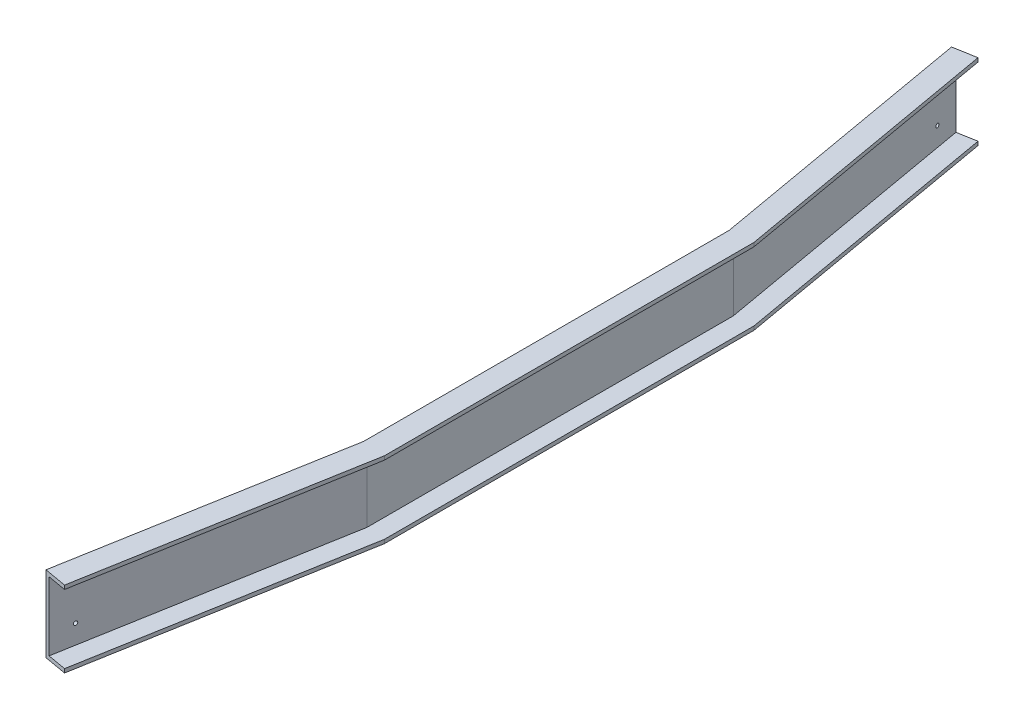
ISO-10303-21;
HEADER;
FILE_DESCRIPTION(('STEP AP214'),'2;1');
FILE_NAME('part.step','',(''),(''),'','','');
FILE_SCHEMA(('AUTOMOTIVE_DESIGN { 1 0 10303 214 1 1 1 1 }'));
ENDSEC;
DATA;
#1=APPLICATION_CONTEXT('core data for automotive mechanical design processes');
#2=APPLICATION_PROTOCOL_DEFINITION('international standard','automotive_design',2000,#1);
#3=PRODUCT_CONTEXT('',#1,'mechanical');
#4=PRODUCT('Part','Part','',(#3));
#5=PRODUCT_RELATED_PRODUCT_CATEGORY('part','',(#4));
#6=PRODUCT_DEFINITION_FORMATION('','',#4);
#7=PRODUCT_DEFINITION_CONTEXT('part definition',#1,'design');
#8=PRODUCT_DEFINITION('design','',#6,#7);
#9=PRODUCT_DEFINITION_SHAPE('','',#8);
#10=(LENGTH_UNIT() NAMED_UNIT(*) SI_UNIT(.MILLI.,.METRE.));
#11=(NAMED_UNIT(*) PLANE_ANGLE_UNIT() SI_UNIT($,.RADIAN.));
#12=(NAMED_UNIT(*) SI_UNIT($,.STERADIAN.) SOLID_ANGLE_UNIT());
#13=UNCERTAINTY_MEASURE_WITH_UNIT(LENGTH_MEASURE(1.E-05),#10,'distance_accuracy_value','');
#14=(GEOMETRIC_REPRESENTATION_CONTEXT(3) GLOBAL_UNCERTAINTY_ASSIGNED_CONTEXT((#13)) GLOBAL_UNIT_ASSIGNED_CONTEXT((#10,
#11,#12)) REPRESENTATION_CONTEXT('',''));
#15=CARTESIAN_POINT('',(0.,0.,0.));
#16=DIRECTION('',(0.,0.,1.));
#17=DIRECTION('',(1.,0.,0.));
#18=AXIS2_PLACEMENT_3D('',#15,#16,#17);
#19=CARTESIAN_POINT('',(-3.93704086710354E-13,0.,-609.6));
#20=DIRECTION('',(0.984807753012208,0.,-0.17364817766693));
#21=DIRECTION('',(-0.173648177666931,0.,-0.984807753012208));
#22=AXIS2_PLACEMENT_3D('',#19,#20,#21);
#23=PLANE('',#22);
#24=CARTESIAN_POINT('',(-145.551902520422,-177.8,-1435.06585857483));
#25=DIRECTION('',(0.984807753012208,0.,-0.17364817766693));
#26=DIRECTION('',(-0.173648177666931,0.,-0.984807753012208));
#27=AXIS2_PLACEMENT_3D('',#24,#25,#26);
#28=CIRCLE('',#27,6.35000000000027);
#29=CARTESIAN_POINT('',(-144.449236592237,-177.8,-1428.81232934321));
#30=VERTEX_POINT('',#29);
#31=EDGE_CURVE('E282',#30,#30,#28,.T.);
#32=ORIENTED_EDGE('',*,*,#31,.T.);
#33=EDGE_LOOP('',(#32));
#34=FACE_BOUND('',#33,.T.);
#35=DIRECTION('',(0.,1.,0.));
#36=VECTOR('',#35,1.);
#37=CARTESIAN_POINT('',(-158.783893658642,-1.01252929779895E-13,-1510.10820935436));
#38=LINE('',#37,#36);
#39=CARTESIAN_POINT('',(-158.783893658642,-254.,-1510.10820935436));
#40=VERTEX_POINT('',#39);
#41=CARTESIAN_POINT('',(-158.783893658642,-1.04129797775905E-13,-1510.10820935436));
#42=VERTEX_POINT('',#41);
#43=EDGE_CURVE('E308',#40,#42,#38,.T.);
#44=ORIENTED_EDGE('',*,*,#43,.F.);
#45=DIRECTION('',(-0.173648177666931,0.,-0.984807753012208));
#46=VECTOR('',#45,1.);
#47=CARTESIAN_POINT('',(-6.24402077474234E-13,-254.,-609.6));
#48=LINE('',#47,#46);
#49=CARTESIAN_POINT('',(-6.24402077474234E-13,-254.,-609.6));
#50=VERTEX_POINT('',#49);
#51=EDGE_CURVE('E176',#50,#40,#48,.T.);
#52=ORIENTED_EDGE('',*,*,#51,.F.);
#53=DIRECTION('',(0.,-1.,0.));
#54=VECTOR('',#53,1.);
#55=CARTESIAN_POINT('',(-3.93704086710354E-13,0.,-609.6));
#56=LINE('',#55,#54);
#57=CARTESIAN_POINT('',(-3.93704086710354E-13,0.,-609.6));
#58=VERTEX_POINT('',#57);
#59=EDGE_CURVE('E173',#58,#50,#56,.T.);
#60=ORIENTED_EDGE('',*,*,#59,.F.);
#61=DIRECTION('',(-0.173648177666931,0.,-0.984807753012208));
#62=VECTOR('',#61,1.);
#63=CARTESIAN_POINT('',(-3.93704086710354E-13,0.,-609.6));
#64=LINE('',#63,#62);
#65=EDGE_CURVE('E172',#58,#42,#64,.T.);
#66=ORIENTED_EDGE('',*,*,#65,.T.);
#67=EDGE_LOOP('',(#44,#52,#60,#66));
#68=FACE_BOUND('',#67,.T.);
#69=CARTESIAN_POINT('',(-145.551902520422,-50.8000000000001,-1435.06585857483));
#70=DIRECTION('',(0.984807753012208,0.,-0.17364817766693));
#71=DIRECTION('',(-0.173648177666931,0.,-0.984807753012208));
#72=AXIS2_PLACEMENT_3D('',#69,#70,#71);
#73=CIRCLE('',#72,6.35000000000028);
#74=CARTESIAN_POINT('',(-144.449236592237,-50.8000000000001,-1428.81232934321));
#75=VERTEX_POINT('',#74);
#76=EDGE_CURVE('E279',#75,#75,#73,.T.);
#77=ORIENTED_EDGE('',*,*,#76,.T.);
#78=EDGE_LOOP('',(#77));
#79=FACE_BOUND('',#78,.T.);
#80=CARTESIAN_POINT('',(-13.4932787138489,-50.8,-686.124186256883));
#81=DIRECTION('',(0.984807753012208,0.,-0.17364817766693));
#82=DIRECTION('',(-0.173648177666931,0.,-0.984807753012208));
#83=AXIS2_PLACEMENT_3D('',#80,#81,#82);
#84=CIRCLE('',#83,6.34999999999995);
#85=CARTESIAN_POINT('',(-12.3906127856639,-50.8,-679.870657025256));
#86=VERTEX_POINT('',#85);
#87=EDGE_CURVE('E292',#86,#86,#84,.T.);
#88=ORIENTED_EDGE('',*,*,#87,.T.);
#89=EDGE_LOOP('',(#88));
#90=FACE_BOUND('',#89,.T.);
#91=ADVANCED_FACE('F33',(#34,#68,#79,#90),#23,.F.);
#92=CARTESIAN_POINT('',(12.6999999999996,-12.7,-610.711106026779));
#93=DIRECTION('',(0.984807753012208,0.,-0.17364817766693));
#94=DIRECTION('',(-0.173648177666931,0.,-0.984807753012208));
#95=AXIS2_PLACEMENT_3D('',#92,#93,#94);
#96=PLANE('',#95);
#97=CARTESIAN_POINT('',(-133.044844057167,-177.8,-1437.2711904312));
#98=DIRECTION('',(0.984807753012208,0.,-0.17364817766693));
#99=DIRECTION('',(-0.173648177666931,0.,-0.984807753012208));
#100=AXIS2_PLACEMENT_3D('',#97,#98,#99);
#101=CIRCLE('',#100,6.35000000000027);
#102=CARTESIAN_POINT('',(-131.942178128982,-177.8,-1431.01766119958));
#103=VERTEX_POINT('',#102);
#104=EDGE_CURVE('E280',#103,#103,#101,.F.);
#105=ORIENTED_EDGE('',*,*,#104,.T.);
#106=EDGE_LOOP('',(#105));
#107=FACE_BOUND('',#106,.T.);
#108=DIRECTION('',(-0.173648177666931,0.,-0.984807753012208));
#109=VECTOR('',#108,1.);
#110=CARTESIAN_POINT('',(12.6999999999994,-241.3,-610.711106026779));
#111=LINE('',#110,#109);
#112=CARTESIAN_POINT('',(12.6999999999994,-241.3,-610.711106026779));
#113=VERTEX_POINT('',#112);
#114=CARTESIAN_POINT('',(-146.276835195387,-241.3,-1512.31354121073));
#115=VERTEX_POINT('',#114);
#116=EDGE_CURVE('E191',#113,#115,#111,.T.);
#117=ORIENTED_EDGE('',*,*,#116,.T.);
#118=DIRECTION('',(0.,1.,0.));
#119=VECTOR('',#118,1.);
#120=CARTESIAN_POINT('',(-146.276835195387,-12.7000000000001,-1512.31354121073));
#121=LINE('',#120,#119);
#122=CARTESIAN_POINT('',(-146.276835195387,-12.7000000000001,-1512.31354121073));
#123=VERTEX_POINT('',#122);
#124=EDGE_CURVE('E297',#115,#123,#121,.T.);
#125=ORIENTED_EDGE('',*,*,#124,.T.);
#126=DIRECTION('',(-0.173648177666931,0.,-0.984807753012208));
#127=VECTOR('',#126,1.);
#128=CARTESIAN_POINT('',(12.6999999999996,-12.7,-610.711106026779));
#129=LINE('',#128,#127);
#130=CARTESIAN_POINT('',(12.6999999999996,-12.7,-610.711106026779));
#131=VERTEX_POINT('',#130);
#132=EDGE_CURVE('E194',#131,#123,#129,.T.);
#133=ORIENTED_EDGE('',*,*,#132,.F.);
#134=DIRECTION('',(0.,-1.,0.));
#135=VECTOR('',#134,1.);
#136=CARTESIAN_POINT('',(12.6999999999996,-12.7,-610.711106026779));
#137=LINE('',#136,#135);
#138=EDGE_CURVE('E278',#131,#113,#137,.T.);
#139=ORIENTED_EDGE('',*,*,#138,.T.);
#140=EDGE_LOOP('',(#117,#125,#133,#139));
#141=FACE_BOUND('',#140,.T.);
#142=CARTESIAN_POINT('',(-133.044844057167,-50.8000000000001,-1437.2711904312));
#143=DIRECTION('',(0.984807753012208,0.,-0.17364817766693));
#144=DIRECTION('',(-0.173648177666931,0.,-0.984807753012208));
#145=AXIS2_PLACEMENT_3D('',#142,#143,#144);
#146=CIRCLE('',#145,6.35000000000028);
#147=CARTESIAN_POINT('',(-131.942178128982,-50.8000000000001,-1431.01766119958));
#148=VERTEX_POINT('',#147);
#149=EDGE_CURVE('E276',#148,#148,#146,.F.);
#150=ORIENTED_EDGE('',*,*,#149,.T.);
#151=EDGE_LOOP('',(#150));
#152=FACE_BOUND('',#151,.T.);
#153=CARTESIAN_POINT('',(-0.986220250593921,-50.8,-688.329518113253));
#154=DIRECTION('',(0.984807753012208,0.,-0.17364817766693));
#155=DIRECTION('',(-0.173648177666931,0.,-0.984807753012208));
#156=AXIS2_PLACEMENT_3D('',#153,#154,#155);
#157=CIRCLE('',#156,6.34999999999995);
#158=CARTESIAN_POINT('',(0.116445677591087,-50.8,-682.075988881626));
#159=VERTEX_POINT('',#158);
#160=EDGE_CURVE('E37',#159,#159,#157,.F.);
#161=ORIENTED_EDGE('',*,*,#160,.T.);
#162=EDGE_LOOP('',(#161));
#163=FACE_BOUND('',#162,.T.);
#164=ADVANCED_FACE('F352',(#107,#141,#152,#163),#96,.T.);
#165=CARTESIAN_POINT('',(2.4440008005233E-13,0.,609.6));
#166=DIRECTION('',(-0.984807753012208,0.,-0.173648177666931));
#167=DIRECTION('',(-0.17364817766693,0.,0.984807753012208));
#168=AXIS2_PLACEMENT_3D('',#165,#166,#167);
#169=PLANE('',#168);
#170=CARTESIAN_POINT('',(-13.4932787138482,-50.8,686.124186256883));
#171=DIRECTION('',(-0.984807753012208,0.,-0.173648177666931));
#172=DIRECTION('',(-0.17364817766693,0.,0.984807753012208));
#173=AXIS2_PLACEMENT_3D('',#170,#171,#172);
#174=CIRCLE('',#173,6.34999999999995);
#175=CARTESIAN_POINT('',(-14.5959446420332,-50.8,692.377715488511));
#176=VERTEX_POINT('',#175);
#177=EDGE_CURVE('E200',#176,#176,#174,.T.);
#178=ORIENTED_EDGE('',*,*,#177,.F.);
#179=EDGE_LOOP('',(#178));
#180=FACE_BOUND('',#179,.T.);
#181=CARTESIAN_POINT('',(-145.551902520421,-177.8,1435.06585857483));
#182=DIRECTION('',(-0.984807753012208,0.,-0.173648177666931));
#183=DIRECTION('',(-0.17364817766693,0.,0.984807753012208));
#184=AXIS2_PLACEMENT_3D('',#181,#182,#183);
#185=CIRCLE('',#184,6.35000000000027);
#186=CARTESIAN_POINT('',(-146.654568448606,-177.8,1441.31938780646));
#187=VERTEX_POINT('',#186);
#188=EDGE_CURVE('E205',#187,#187,#185,.T.);
#189=ORIENTED_EDGE('',*,*,#188,.F.);
#190=EDGE_LOOP('',(#189));
#191=FACE_BOUND('',#190,.T.);
#192=CARTESIAN_POINT('',(-145.551902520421,-50.8000000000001,1435.06585857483));
#193=DIRECTION('',(-0.984807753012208,0.,-0.173648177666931));
#194=DIRECTION('',(-0.17364817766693,0.,0.984807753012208));
#195=AXIS2_PLACEMENT_3D('',#192,#193,#194);
#196=CIRCLE('',#195,6.35000000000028);
#197=CARTESIAN_POINT('',(-146.654568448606,-50.8000000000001,1441.31938780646));
#198=VERTEX_POINT('',#197);
#199=EDGE_CURVE('E209',#198,#198,#196,.T.);
#200=ORIENTED_EDGE('',*,*,#199,.F.);
#201=EDGE_LOOP('',(#200));
#202=FACE_BOUND('',#201,.T.);
#203=DIRECTION('',(-0.17364817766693,0.,0.984807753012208));
#204=VECTOR('',#203,1.);
#205=CARTESIAN_POINT('',(0.,-254.,609.6));
#206=LINE('',#205,#204);
#207=CARTESIAN_POINT('',(0.,-254.,609.6));
#208=VERTEX_POINT('',#207);
#209=CARTESIAN_POINT('',(-158.783893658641,-254.,1510.10820935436));
#210=VERTEX_POINT('',#209);
#211=EDGE_CURVE('E266',#208,#210,#206,.T.);
#212=ORIENTED_EDGE('',*,*,#211,.T.);
#213=DIRECTION('',(0.,1.,0.));
#214=VECTOR('',#213,1.);
#215=CARTESIAN_POINT('',(-158.783893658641,-1.01252929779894E-13,1510.10820935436));
#216=LINE('',#215,#214);
#217=CARTESIAN_POINT('',(-158.783893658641,-1.04129799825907E-13,1510.10820935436));
#218=VERTEX_POINT('',#217);
#219=EDGE_CURVE('E221',#210,#218,#216,.T.);
#220=ORIENTED_EDGE('',*,*,#219,.T.);
#221=DIRECTION('',(-0.17364817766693,0.,0.984807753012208));
#222=VECTOR('',#221,1.);
#223=CARTESIAN_POINT('',(2.4440008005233E-13,0.,609.6));
#224=LINE('',#223,#222);
#225=CARTESIAN_POINT('',(2.4440008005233E-13,0.,609.6));
#226=VERTEX_POINT('',#225);
#227=EDGE_CURVE('E248',#226,#218,#224,.T.);
#228=ORIENTED_EDGE('',*,*,#227,.F.);
#229=DIRECTION('',(0.,-1.,0.));
#230=VECTOR('',#229,1.);
#231=CARTESIAN_POINT('',(2.4440008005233E-13,0.,609.6));
#232=LINE('',#231,#230);
#233=EDGE_CURVE('E232',#226,#208,#232,.T.);
#234=ORIENTED_EDGE('',*,*,#233,.T.);
#235=EDGE_LOOP('',(#212,#220,#228,#234));
#236=FACE_BOUND('',#235,.T.);
#237=ADVANCED_FACE('F339',(#180,#191,#202,#236),#169,.T.);
#238=CARTESIAN_POINT('',(76.2000000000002,0.,616.266636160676));
#239=DIRECTION('',(-0.984807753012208,0.,-0.173648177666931));
#240=DIRECTION('',(-0.17364817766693,0.,0.984807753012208));
#241=AXIS2_PLACEMENT_3D('',#238,#239,#240);
#242=PLANE('',#241);
#243=DIRECTION('',(0.,1.,0.));
#244=VECTOR('',#243,1.);
#245=CARTESIAN_POINT('',(-83.7415428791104,0.,1523.34020049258));
#246=LINE('',#245,#244);
#247=CARTESIAN_POINT('',(-83.7415428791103,-12.7000000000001,1523.34020049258));
#248=VERTEX_POINT('',#247);
#249=CARTESIAN_POINT('',(-83.7415428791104,0.,1523.34020049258));
#250=VERTEX_POINT('',#249);
#251=EDGE_CURVE('E217',#248,#250,#246,.T.);
#252=ORIENTED_EDGE('',*,*,#251,.F.);
#253=DIRECTION('',(-0.17364817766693,0.,0.984807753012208));
#254=VECTOR('',#253,1.);
#255=CARTESIAN_POINT('',(76.2000000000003,-12.7,616.266636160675));
#256=LINE('',#255,#254);
#257=CARTESIAN_POINT('',(76.2000000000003,-12.7,616.266636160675));
#258=VERTEX_POINT('',#257);
#259=EDGE_CURVE('E252',#258,#248,#256,.T.);
#260=ORIENTED_EDGE('',*,*,#259,.F.);
#261=DIRECTION('',(0.,-1.,0.));
#262=VECTOR('',#261,1.);
#263=CARTESIAN_POINT('',(76.2000000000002,0.,616.266636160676));
#264=LINE('',#263,#262);
#265=CARTESIAN_POINT('',(76.2000000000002,0.,616.266636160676));
#266=VERTEX_POINT('',#265);
#267=EDGE_CURVE('E231',#266,#258,#264,.T.);
#268=ORIENTED_EDGE('',*,*,#267,.F.);
#269=DIRECTION('',(-0.17364817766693,0.,0.984807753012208));
#270=VECTOR('',#269,1.);
#271=CARTESIAN_POINT('',(76.2000000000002,0.,616.266636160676));
#272=LINE('',#271,#270);
#273=EDGE_CURVE('E153',#266,#250,#272,.T.);
#274=ORIENTED_EDGE('',*,*,#273,.T.);
#275=EDGE_LOOP('',(#252,#260,#268,#274));
#276=FACE_BOUND('',#275,.T.);
#277=ADVANCED_FACE('F364',(#276),#242,.F.);
#278=CARTESIAN_POINT('',(12.7000000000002,-12.7,610.711106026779));
#279=DIRECTION('',(-0.984807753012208,0.,-0.173648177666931));
#280=DIRECTION('',(-0.17364817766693,0.,0.984807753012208));
#281=AXIS2_PLACEMENT_3D('',#278,#279,#280);
#282=PLANE('',#281);
#283=CARTESIAN_POINT('',(-0.986220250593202,-50.8,688.329518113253));
#284=DIRECTION('',(-0.984807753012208,0.,-0.173648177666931));
#285=DIRECTION('',(-0.17364817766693,0.,0.984807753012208));
#286=AXIS2_PLACEMENT_3D('',#283,#284,#285);
#287=CIRCLE('',#286,6.34999999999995);
#288=CARTESIAN_POINT('',(-2.0888861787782,-50.8,694.583047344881));
#289=VERTEX_POINT('',#288);
#290=EDGE_CURVE('E203',#289,#289,#287,.T.);
#291=ORIENTED_EDGE('',*,*,#290,.T.);
#292=EDGE_LOOP('',(#291));
#293=FACE_BOUND('',#292,.T.);
#294=CARTESIAN_POINT('',(-133.044844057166,-177.8,1437.2711904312));
#295=DIRECTION('',(-0.984807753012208,0.,-0.173648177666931));
#296=DIRECTION('',(-0.17364817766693,0.,0.984807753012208));
#297=AXIS2_PLACEMENT_3D('',#294,#295,#296);
#298=CIRCLE('',#297,6.35000000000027);
#299=CARTESIAN_POINT('',(-134.147509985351,-177.8,1443.52471966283));
#300=VERTEX_POINT('',#299);
#301=EDGE_CURVE('E208',#300,#300,#298,.T.);
#302=ORIENTED_EDGE('',*,*,#301,.T.);
#303=EDGE_LOOP('',(#302));
#304=FACE_BOUND('',#303,.T.);
#305=CARTESIAN_POINT('',(-133.044844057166,-50.8000000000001,1437.2711904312));
#306=DIRECTION('',(-0.984807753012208,0.,-0.173648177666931));
#307=DIRECTION('',(-0.17364817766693,0.,0.984807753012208));
#308=AXIS2_PLACEMENT_3D('',#305,#306,#307);
#309=CIRCLE('',#308,6.35000000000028);
#310=CARTESIAN_POINT('',(-134.147509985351,-50.8000000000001,1443.52471966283));
#311=VERTEX_POINT('',#310);
#312=EDGE_CURVE('E159',#311,#311,#309,.T.);
#313=ORIENTED_EDGE('',*,*,#312,.T.);
#314=EDGE_LOOP('',(#313));
#315=FACE_BOUND('',#314,.T.);
#316=DIRECTION('',(0.,1.,0.));
#317=VECTOR('',#316,1.);
#318=CARTESIAN_POINT('',(-146.276835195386,-12.7000000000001,1512.31354121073));
#319=LINE('',#318,#317);
#320=CARTESIAN_POINT('',(-146.276835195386,-241.3,1512.31354121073));
#321=VERTEX_POINT('',#320);
#322=CARTESIAN_POINT('',(-146.276835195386,-12.7000000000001,1512.31354121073));
#323=VERTEX_POINT('',#322);
#324=EDGE_CURVE('E213',#321,#323,#319,.T.);
#325=ORIENTED_EDGE('',*,*,#324,.F.);
#326=DIRECTION('',(-0.17364817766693,0.,0.984807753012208));
#327=VECTOR('',#326,1.);
#328=CARTESIAN_POINT('',(12.7,-241.3,610.711106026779));
#329=LINE('',#328,#327);
#330=CARTESIAN_POINT('',(12.7,-241.3,610.711106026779));
#331=VERTEX_POINT('',#330);
#332=EDGE_CURVE('E258',#331,#321,#329,.T.);
#333=ORIENTED_EDGE('',*,*,#332,.F.);
#334=DIRECTION('',(0.,-1.,0.));
#335=VECTOR('',#334,1.);
#336=CARTESIAN_POINT('',(12.7000000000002,-12.7,610.711106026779));
#337=LINE('',#336,#335);
#338=CARTESIAN_POINT('',(12.7000000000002,-12.7,610.711106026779));
#339=VERTEX_POINT('',#338);
#340=EDGE_CURVE('E227',#339,#331,#337,.T.);
#341=ORIENTED_EDGE('',*,*,#340,.F.);
#342=DIRECTION('',(-0.17364817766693,0.,0.984807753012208));
#343=VECTOR('',#342,1.);
#344=CARTESIAN_POINT('',(12.7000000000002,-12.7,610.711106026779));
#345=LINE('',#344,#343);
#346=EDGE_CURVE('E255',#339,#323,#345,.T.);
#347=ORIENTED_EDGE('',*,*,#346,.T.);
#348=EDGE_LOOP('',(#325,#333,#341,#347));
#349=FACE_BOUND('',#348,.T.);
#350=ADVANCED_FACE('F359',(#293,#304,#315,#349),#282,.F.);
#351=CARTESIAN_POINT('',(76.2,-241.3,616.266636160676));
#352=DIRECTION('',(-0.984807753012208,0.,-0.173648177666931));
#353=DIRECTION('',(-0.17364817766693,0.,0.984807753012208));
#354=AXIS2_PLACEMENT_3D('',#351,#352,#353);
#355=PLANE('',#354);
#356=DIRECTION('',(0.,1.,0.));
#357=VECTOR('',#356,1.);
#358=CARTESIAN_POINT('',(-83.7415428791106,-241.3,1523.34020049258));
#359=LINE('',#358,#357);
#360=CARTESIAN_POINT('',(-83.7415428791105,-254.,1523.34020049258));
#361=VERTEX_POINT('',#360);
#362=CARTESIAN_POINT('',(-83.7415428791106,-241.3,1523.34020049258));
#363=VERTEX_POINT('',#362);
#364=EDGE_CURVE('E11',#361,#363,#359,.T.);
#365=ORIENTED_EDGE('',*,*,#364,.F.);
#366=DIRECTION('',(-0.17364817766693,0.,0.984807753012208));
#367=VECTOR('',#366,1.);
#368=CARTESIAN_POINT('',(76.2000000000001,-254.,616.266636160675));
#369=LINE('',#368,#367);
#370=CARTESIAN_POINT('',(76.2000000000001,-254.,616.266636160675));
#371=VERTEX_POINT('',#370);
#372=EDGE_CURVE('E263',#371,#361,#369,.T.);
#373=ORIENTED_EDGE('',*,*,#372,.F.);
#374=DIRECTION('',(0.,-1.,0.));
#375=VECTOR('',#374,1.);
#376=CARTESIAN_POINT('',(76.2,-241.3,616.266636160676));
#377=LINE('',#376,#375);
#378=CARTESIAN_POINT('',(76.2,-241.3,616.266636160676));
#379=VERTEX_POINT('',#378);
#380=EDGE_CURVE('E224',#379,#371,#377,.T.);
#381=ORIENTED_EDGE('',*,*,#380,.F.);
#382=DIRECTION('',(-0.17364817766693,0.,0.984807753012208));
#383=VECTOR('',#382,1.);
#384=CARTESIAN_POINT('',(76.2,-241.3,616.266636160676));
#385=LINE('',#384,#383);
#386=EDGE_CURVE('E261',#379,#363,#385,.T.);
#387=ORIENTED_EDGE('',*,*,#386,.T.);
#388=EDGE_LOOP('',(#365,#373,#381,#387));
#389=FACE_BOUND('',#388,.T.);
#390=ADVANCED_FACE('F35',(#389),#355,.F.);
#391=CARTESIAN_POINT('',(3.52053625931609E-13,0.,878.117103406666));
#392=DIRECTION('',(0.,1.,0.));
#393=DIRECTION('',(0.,0.,1.));
#394=AXIS2_PLACEMENT_3D('',#391,#392,#393);
#395=PLANE('',#394);
#396=DIRECTION('',(0.,0.,-1.));
#397=VECTOR('',#396,1.);
#398=CARTESIAN_POINT('',(3.52053625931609E-13,0.,878.117103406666));
#399=LINE('',#398,#397);
#400=EDGE_CURVE('E228',#226,#58,#399,.T.);
#401=ORIENTED_EDGE('',*,*,#400,.F.);
#402=ORIENTED_EDGE('',*,*,#227,.T.);
#403=DIRECTION('',(-0.984807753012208,0.,-0.173648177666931));
#404=VECTOR('',#403,1.);
#405=CARTESIAN_POINT('',(-135.824329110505,0.,1514.15660004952));
#406=LINE('',#405,#404);
#407=EDGE_CURVE('E219',#250,#218,#406,.T.);
#408=ORIENTED_EDGE('',*,*,#407,.F.);
#409=ORIENTED_EDGE('',*,*,#273,.F.);
#410=DIRECTION('',(0.,0.,-1.));
#411=VECTOR('',#410,1.);
#412=CARTESIAN_POINT('',(76.2000000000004,0.,878.117103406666));
#413=LINE('',#412,#411);
#414=CARTESIAN_POINT('',(76.1999999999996,0.,-616.266636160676));
#415=VERTEX_POINT('',#414);
#416=EDGE_CURVE('E144',#266,#415,#413,.T.);
#417=ORIENTED_EDGE('',*,*,#416,.T.);
#418=DIRECTION('',(-0.173648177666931,0.,-0.984807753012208));
#419=VECTOR('',#418,1.);
#420=CARTESIAN_POINT('',(76.1999999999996,0.,-616.266636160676));
#421=LINE('',#420,#419);
#422=CARTESIAN_POINT('',(-83.741542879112,0.,-1523.34020049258));
#423=VERTEX_POINT('',#422);
#424=EDGE_CURVE('E149',#415,#423,#421,.T.);
#425=ORIENTED_EDGE('',*,*,#424,.T.);
#426=DIRECTION('',(-0.984807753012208,0.,0.17364817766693));
#427=VECTOR('',#426,1.);
#428=CARTESIAN_POINT('',(-135.824329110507,0.,-1514.15660004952));
#429=LINE('',#428,#427);
#430=EDGE_CURVE('E199',#423,#42,#429,.T.);
#431=ORIENTED_EDGE('',*,*,#430,.T.);
#432=ORIENTED_EDGE('',*,*,#65,.F.);
#433=EDGE_LOOP('',(#401,#402,#408,#409,#417,#425,#431,#432));
#434=FACE_BOUND('',#433,.T.);
#435=ADVANCED_FACE('F147',(#434),#395,.T.);
#436=CARTESIAN_POINT('',(76.2000000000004,0.,878.117103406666));
#437=DIRECTION('',(1.,0.,0.));
#438=DIRECTION('',(0.,0.,-1.));
#439=AXIS2_PLACEMENT_3D('',#436,#437,#438);
#440=PLANE('',#439);
#441=ORIENTED_EDGE('',*,*,#416,.F.);
#442=ORIENTED_EDGE('',*,*,#267,.T.);
#443=DIRECTION('',(0.,0.,-1.));
#444=VECTOR('',#443,1.);
#445=CARTESIAN_POINT('',(76.2000000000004,-12.7,878.117103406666));
#446=LINE('',#445,#444);
#447=CARTESIAN_POINT('',(76.1999999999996,-12.7,-616.266636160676));
#448=VERTEX_POINT('',#447);
#449=EDGE_CURVE('E158',#258,#448,#446,.T.);
#450=ORIENTED_EDGE('',*,*,#449,.T.);
#451=DIRECTION('',(0.,-1.,0.));
#452=VECTOR('',#451,1.);
#453=CARTESIAN_POINT('',(76.1999999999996,0.,-616.266636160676));
#454=LINE('',#453,#452);
#455=EDGE_CURVE('E165',#415,#448,#454,.T.);
#456=ORIENTED_EDGE('',*,*,#455,.F.);
#457=EDGE_LOOP('',(#441,#442,#450,#456));
#458=FACE_BOUND('',#457,.T.);
#459=ADVANCED_FACE('F169',(#458),#440,.T.);
#460=CARTESIAN_POINT('',(76.2000000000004,-12.7,878.117103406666));
#461=DIRECTION('',(0.,-1.,0.));
#462=DIRECTION('',(1.,0.,0.));
#463=AXIS2_PLACEMENT_3D('',#460,#461,#462);
#464=PLANE('',#463);
#465=ORIENTED_EDGE('',*,*,#449,.F.);
#466=ORIENTED_EDGE('',*,*,#259,.T.);
#467=DIRECTION('',(0.984807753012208,0.,0.173648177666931));
#468=VECTOR('',#467,1.);
#469=CARTESIAN_POINT('',(-61.3520092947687,-12.7,1527.28807934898));
#470=LINE('',#469,#468);
#471=EDGE_CURVE('E215',#323,#248,#470,.T.);
#472=ORIENTED_EDGE('',*,*,#471,.F.);
#473=ORIENTED_EDGE('',*,*,#346,.F.);
#474=DIRECTION('',(0.,0.,-1.));
#475=VECTOR('',#474,1.);
#476=CARTESIAN_POINT('',(12.7000000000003,-12.7,878.117103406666));
#477=LINE('',#476,#475);
#478=EDGE_CURVE('E235',#339,#131,#477,.T.);
#479=ORIENTED_EDGE('',*,*,#478,.T.);
#480=ORIENTED_EDGE('',*,*,#132,.T.);
#481=DIRECTION('',(0.984807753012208,0.,-0.17364817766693));
#482=VECTOR('',#481,1.);
#483=CARTESIAN_POINT('',(-61.3520092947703,-12.7,-1527.28807934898));
#484=LINE('',#483,#482);
#485=CARTESIAN_POINT('',(-83.741542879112,-12.7000000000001,-1523.34020049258));
#486=VERTEX_POINT('',#485);
#487=EDGE_CURVE('E204',#123,#486,#484,.T.);
#488=ORIENTED_EDGE('',*,*,#487,.T.);
#489=DIRECTION('',(-0.173648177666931,0.,-0.984807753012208));
#490=VECTOR('',#489,1.);
#491=CARTESIAN_POINT('',(76.1999999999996,-12.7,-616.266636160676));
#492=LINE('',#491,#490);
#493=EDGE_CURVE('E167',#448,#486,#492,.T.);
#494=ORIENTED_EDGE('',*,*,#493,.F.);
#495=EDGE_LOOP('',(#465,#466,#472,#473,#479,#480,#488,#494));
#496=FACE_BOUND('',#495,.T.);
#497=ADVANCED_FACE('F347',(#496),#464,.T.);
#498=CARTESIAN_POINT('',(12.7000000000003,-12.7,878.117103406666));
#499=DIRECTION('',(1.,0.,0.));
#500=DIRECTION('',(0.,1.,0.));
#501=AXIS2_PLACEMENT_3D('',#498,#499,#500);
#502=PLANE('',#501);
#503=ORIENTED_EDGE('',*,*,#478,.F.);
#504=ORIENTED_EDGE('',*,*,#340,.T.);
#505=DIRECTION('',(0.,0.,-1.));
#506=VECTOR('',#505,1.);
#507=CARTESIAN_POINT('',(12.7000000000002,-241.3,878.117103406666));
#508=LINE('',#507,#506);
#509=EDGE_CURVE('E237',#331,#113,#508,.T.);
#510=ORIENTED_EDGE('',*,*,#509,.T.);
#511=ORIENTED_EDGE('',*,*,#138,.F.);
#512=EDGE_LOOP('',(#503,#504,#510,#511));
#513=FACE_BOUND('',#512,.T.);
#514=ADVANCED_FACE('F356',(#513),#502,.T.);
#515=CARTESIAN_POINT('',(12.7000000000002,-241.3,878.117103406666));
#516=DIRECTION('',(0.,1.,0.));
#517=DIRECTION('',(-1.,0.,0.));
#518=AXIS2_PLACEMENT_3D('',#515,#516,#517);
#519=PLANE('',#518);
#520=ORIENTED_EDGE('',*,*,#509,.F.);
#521=ORIENTED_EDGE('',*,*,#332,.T.);
#522=DIRECTION('',(-0.984807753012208,0.,-0.173648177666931));
#523=VECTOR('',#522,1.);
#524=CARTESIAN_POINT('',(-123.412275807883,-241.3,1516.34517993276));
#525=LINE('',#524,#523);
#526=EDGE_CURVE('E42',#363,#321,#525,.T.);
#527=ORIENTED_EDGE('',*,*,#526,.F.);
#528=ORIENTED_EDGE('',*,*,#386,.F.);
#529=DIRECTION('',(0.,0.,-1.));
#530=VECTOR('',#529,1.);
#531=CARTESIAN_POINT('',(76.2000000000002,-241.3,878.117103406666));
#532=LINE('',#531,#530);
#533=CARTESIAN_POINT('',(76.1999999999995,-241.3,-616.266636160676));
#534=VERTEX_POINT('',#533);
#535=EDGE_CURVE('E239',#379,#534,#532,.T.);
#536=ORIENTED_EDGE('',*,*,#535,.T.);
#537=DIRECTION('',(-0.173648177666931,0.,-0.984807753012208));
#538=VECTOR('',#537,1.);
#539=CARTESIAN_POINT('',(76.1999999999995,-241.3,-616.266636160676));
#540=LINE('',#539,#538);
#541=CARTESIAN_POINT('',(-83.7415428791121,-241.3,-1523.34020049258));
#542=VERTEX_POINT('',#541);
#543=EDGE_CURVE('E188',#534,#542,#540,.T.);
#544=ORIENTED_EDGE('',*,*,#543,.T.);
#545=DIRECTION('',(-0.984807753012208,0.,0.17364817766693));
#546=VECTOR('',#545,1.);
#547=CARTESIAN_POINT('',(-123.412275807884,-241.3,-1516.34517993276));
#548=LINE('',#547,#546);
#549=EDGE_CURVE('E300',#542,#115,#548,.T.);
#550=ORIENTED_EDGE('',*,*,#549,.T.);
#551=ORIENTED_EDGE('',*,*,#116,.F.);
#552=EDGE_LOOP('',(#520,#521,#527,#528,#536,#544,#550,#551));
#553=FACE_BOUND('',#552,.T.);
#554=ADVANCED_FACE('F333',(#553),#519,.T.);
#555=CARTESIAN_POINT('',(76.2000000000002,-241.3,878.117103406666));
#556=DIRECTION('',(1.,0.,0.));
#557=DIRECTION('',(0.,1.,0.));
#558=AXIS2_PLACEMENT_3D('',#555,#556,#557);
#559=PLANE('',#558);
#560=ORIENTED_EDGE('',*,*,#535,.F.);
#561=ORIENTED_EDGE('',*,*,#380,.T.);
#562=DIRECTION('',(0.,0.,-1.));
#563=VECTOR('',#562,1.);
#564=CARTESIAN_POINT('',(76.2000000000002,-254.,878.117103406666));
#565=LINE('',#564,#563);
#566=CARTESIAN_POINT('',(76.1999999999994,-254.,-616.266636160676));
#567=VERTEX_POINT('',#566);
#568=EDGE_CURVE('E241',#371,#567,#565,.T.);
#569=ORIENTED_EDGE('',*,*,#568,.T.);
#570=DIRECTION('',(0.,-1.,0.));
#571=VECTOR('',#570,1.);
#572=CARTESIAN_POINT('',(76.1999999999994,-241.3,-616.266636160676));
#573=LINE('',#572,#571);
#574=EDGE_CURVE('E179',#534,#567,#573,.T.);
#575=ORIENTED_EDGE('',*,*,#574,.F.);
#576=EDGE_LOOP('',(#560,#561,#569,#575));
#577=FACE_BOUND('',#576,.T.);
#578=ADVANCED_FACE('F321',(#577),#559,.T.);
#579=CARTESIAN_POINT('',(1.54376508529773E-13,-254.,878.117103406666));
#580=DIRECTION('',(0.,1.,0.));
#581=DIRECTION('',(0.,0.,1.));
#582=AXIS2_PLACEMENT_3D('',#579,#580,#581);
#583=PLANE('',#582);
#584=ORIENTED_EDGE('',*,*,#568,.F.);
#585=ORIENTED_EDGE('',*,*,#372,.T.);
#586=DIRECTION('',(-0.984807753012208,0.,-0.173648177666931));
#587=VECTOR('',#586,1.);
#588=CARTESIAN_POINT('',(-135.824329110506,-254.,1514.15660004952));
#589=LINE('',#588,#587);
#590=EDGE_CURVE('E49',#361,#210,#589,.T.);
#591=ORIENTED_EDGE('',*,*,#590,.T.);
#592=ORIENTED_EDGE('',*,*,#211,.F.);
#593=DIRECTION('',(0.,0.,-1.));
#594=VECTOR('',#593,1.);
#595=CARTESIAN_POINT('',(1.54376508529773E-13,-254.,878.117103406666));
#596=LINE('',#595,#594);
#597=EDGE_CURVE('E243',#208,#50,#596,.T.);
#598=ORIENTED_EDGE('',*,*,#597,.T.);
#599=ORIENTED_EDGE('',*,*,#51,.T.);
#600=DIRECTION('',(-0.984807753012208,0.,0.17364817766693));
#601=VECTOR('',#600,1.);
#602=CARTESIAN_POINT('',(-135.824329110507,-254.,-1514.15660004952));
#603=LINE('',#602,#601);
#604=CARTESIAN_POINT('',(-83.7415428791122,-254.,-1523.34020049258));
#605=VERTEX_POINT('',#604);
#606=EDGE_CURVE('E306',#605,#40,#603,.T.);
#607=ORIENTED_EDGE('',*,*,#606,.F.);
#608=DIRECTION('',(-0.173648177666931,0.,-0.984807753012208));
#609=VECTOR('',#608,1.);
#610=CARTESIAN_POINT('',(76.1999999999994,-254.,-616.266636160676));
#611=LINE('',#610,#609);
#612=EDGE_CURVE('E185',#567,#605,#611,.T.);
#613=ORIENTED_EDGE('',*,*,#612,.F.);
#614=EDGE_LOOP('',(#584,#585,#591,#592,#598,#599,#607,#613));
#615=FACE_BOUND('',#614,.T.);
#616=ADVANCED_FACE('F325',(#615),#583,.F.);
#617=CARTESIAN_POINT('',(3.52053625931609E-13,0.,878.117103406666));
#618=DIRECTION('',(1.,0.,0.));
#619=DIRECTION('',(0.,1.,0.));
#620=AXIS2_PLACEMENT_3D('',#617,#618,#619);
#621=PLANE('',#620);
#622=ORIENTED_EDGE('',*,*,#233,.F.);
#623=ORIENTED_EDGE('',*,*,#400,.T.);
#624=ORIENTED_EDGE('',*,*,#59,.T.);
#625=ORIENTED_EDGE('',*,*,#597,.F.);
#626=EDGE_LOOP('',(#622,#623,#624,#625));
#627=FACE_BOUND('',#626,.T.);
#628=ADVANCED_FACE('F341',(#627),#621,.F.);
#629=CARTESIAN_POINT('',(-121.262718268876,-127.,1516.72420492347));
#630=DIRECTION('',(-0.17364817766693,0.,0.984807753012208));
#631=DIRECTION('',(0.984807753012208,0.,0.173648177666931));
#632=AXIS2_PLACEMENT_3D('',#629,#630,#631);
#633=PLANE('',#632);
#634=ORIENTED_EDGE('',*,*,#590,.F.);
#635=ORIENTED_EDGE('',*,*,#364,.T.);
#636=ORIENTED_EDGE('',*,*,#526,.T.);
#637=ORIENTED_EDGE('',*,*,#324,.T.);
#638=ORIENTED_EDGE('',*,*,#471,.T.);
#639=ORIENTED_EDGE('',*,*,#251,.T.);
#640=ORIENTED_EDGE('',*,*,#407,.T.);
#641=ORIENTED_EDGE('',*,*,#219,.F.);
#642=EDGE_LOOP('',(#634,#635,#636,#637,#638,#639,#640,#641));
#643=FACE_BOUND('',#642,.T.);
#644=ADVANCED_FACE('F361',(#643),#633,.T.);
#645=CARTESIAN_POINT('',(84.6091634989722,-50.8,1475.64946442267));
#646=DIRECTION('',(-0.984807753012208,0.,-0.173648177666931));
#647=DIRECTION('',(-0.17364817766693,0.,0.984807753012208));
#648=AXIS2_PLACEMENT_3D('',#645,#646,#647);
#649=CYLINDRICAL_SURFACE('',#648,6.35000000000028);
#650=ORIENTED_EDGE('',*,*,#199,.T.);
#651=EDGE_LOOP('',(#650));
#652=FACE_BOUND('',#651,.T.);
#653=ORIENTED_EDGE('',*,*,#312,.F.);
#654=EDGE_LOOP('',(#653));
#655=FACE_BOUND('',#654,.T.);
#656=ADVANCED_FACE('F394',(#652,#655),#649,.F.);
#657=CARTESIAN_POINT('',(84.6091634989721,-177.8,1475.64946442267));
#658=DIRECTION('',(-0.984807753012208,0.,-0.173648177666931));
#659=DIRECTION('',(-0.17364817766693,0.,0.984807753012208));
#660=AXIS2_PLACEMENT_3D('',#657,#658,#659);
#661=CYLINDRICAL_SURFACE('',#660,6.35000000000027);
#662=ORIENTED_EDGE('',*,*,#188,.T.);
#663=EDGE_LOOP('',(#662));
#664=FACE_BOUND('',#663,.T.);
#665=ORIENTED_EDGE('',*,*,#301,.F.);
#666=EDGE_LOOP('',(#665));
#667=FACE_BOUND('',#666,.T.);
#668=ADVANCED_FACE('F390',(#664,#667),#661,.F.);
#669=CARTESIAN_POINT('',(216.667787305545,-50.7999999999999,726.707792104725));
#670=DIRECTION('',(-0.984807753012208,0.,-0.173648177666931));
#671=DIRECTION('',(-0.17364817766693,0.,0.984807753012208));
#672=AXIS2_PLACEMENT_3D('',#669,#670,#671);
#673=CYLINDRICAL_SURFACE('',#672,6.34999999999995);
#674=ORIENTED_EDGE('',*,*,#177,.T.);
#675=EDGE_LOOP('',(#674));
#676=FACE_BOUND('',#675,.T.);
#677=ORIENTED_EDGE('',*,*,#290,.F.);
#678=EDGE_LOOP('',(#677));
#679=FACE_BOUND('',#678,.T.);
#680=ADVANCED_FACE('F384',(#676,#679),#673,.F.);
#681=CARTESIAN_POINT('',(76.1999999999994,-241.3,-616.266636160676));
#682=DIRECTION('',(0.984807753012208,0.,-0.17364817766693));
#683=DIRECTION('',(-0.173648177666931,0.,-0.984807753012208));
#684=AXIS2_PLACEMENT_3D('',#681,#682,#683);
#685=PLANE('',#684);
#686=ORIENTED_EDGE('',*,*,#612,.T.);
#687=DIRECTION('',(0.,1.,0.));
#688=VECTOR('',#687,1.);
#689=CARTESIAN_POINT('',(-83.7415428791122,-241.3,-1523.34020049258));
#690=LINE('',#689,#688);
#691=EDGE_CURVE('E303',#605,#542,#690,.T.);
#692=ORIENTED_EDGE('',*,*,#691,.T.);
#693=ORIENTED_EDGE('',*,*,#543,.F.);
#694=ORIENTED_EDGE('',*,*,#574,.T.);
#695=EDGE_LOOP('',(#686,#692,#693,#694));
#696=FACE_BOUND('',#695,.T.);
#697=ADVANCED_FACE('F316',(#696),#685,.T.);
#698=CARTESIAN_POINT('',(76.1999999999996,0.,-616.266636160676));
#699=DIRECTION('',(0.984807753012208,0.,-0.17364817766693));
#700=DIRECTION('',(-0.173648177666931,0.,-0.984807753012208));
#701=AXIS2_PLACEMENT_3D('',#698,#699,#700);
#702=PLANE('',#701);
#703=ORIENTED_EDGE('',*,*,#493,.T.);
#704=DIRECTION('',(0.,1.,0.));
#705=VECTOR('',#704,1.);
#706=CARTESIAN_POINT('',(-83.741542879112,0.,-1523.34020049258));
#707=LINE('',#706,#705);
#708=EDGE_CURVE('E166',#486,#423,#707,.T.);
#709=ORIENTED_EDGE('',*,*,#708,.T.);
#710=ORIENTED_EDGE('',*,*,#424,.F.);
#711=ORIENTED_EDGE('',*,*,#455,.T.);
#712=EDGE_LOOP('',(#703,#709,#710,#711));
#713=FACE_BOUND('',#712,.T.);
#714=ADVANCED_FACE('F164',(#713),#702,.T.);
#715=CARTESIAN_POINT('',(-121.262718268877,-127.,-1516.72420492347));
#716=DIRECTION('',(-0.173648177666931,0.,-0.984807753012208));
#717=DIRECTION('',(-0.984807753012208,0.,0.17364817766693));
#718=AXIS2_PLACEMENT_3D('',#715,#716,#717);
#719=PLANE('',#718);
#720=ORIENTED_EDGE('',*,*,#708,.F.);
#721=ORIENTED_EDGE('',*,*,#487,.F.);
#722=ORIENTED_EDGE('',*,*,#124,.F.);
#723=ORIENTED_EDGE('',*,*,#549,.F.);
#724=ORIENTED_EDGE('',*,*,#691,.F.);
#725=ORIENTED_EDGE('',*,*,#606,.T.);
#726=ORIENTED_EDGE('',*,*,#43,.T.);
#727=ORIENTED_EDGE('',*,*,#430,.F.);
#728=EDGE_LOOP('',(#720,#721,#722,#723,#724,#725,#726,#727));
#729=FACE_BOUND('',#728,.T.);
#730=ADVANCED_FACE('F329',(#729),#719,.T.);
#731=CARTESIAN_POINT('',(84.6091634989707,-50.8,-1475.64946442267));
#732=DIRECTION('',(-0.984807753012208,0.,0.17364817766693));
#733=DIRECTION('',(0.173648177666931,0.,0.984807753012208));
#734=AXIS2_PLACEMENT_3D('',#731,#732,#733);
#735=CYLINDRICAL_SURFACE('',#734,6.35000000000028);
#736=CARTESIAN_POINT('',(-131.942178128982,-50.8000000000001,-1431.01766119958));
#737=CARTESIAN_POINT('',(-132.072459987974,-50.8000000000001,-1430.99468899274));
#738=CARTESIAN_POINT('',(-132.202741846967,-50.8000000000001,-1430.9717167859));
#739=CARTESIAN_POINT('',(-132.463305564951,-50.8000000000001,-1430.92577237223));
#740=CARTESIAN_POINT('',(-132.593587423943,-50.8000000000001,-1430.90280016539));
#741=CARTESIAN_POINT('',(-132.854151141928,-50.8000000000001,-1430.85685575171));
#742=CARTESIAN_POINT('',(-132.98443300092,-50.8000000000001,-1430.83388354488));
#743=CARTESIAN_POINT('',(-133.244996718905,-50.8000000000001,-1430.7879391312));
#744=CARTESIAN_POINT('',(-133.375278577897,-50.8000000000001,-1430.76496692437));
#745=CARTESIAN_POINT('',(-133.635842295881,-50.8000000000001,-1430.71902251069));
#746=CARTESIAN_POINT('',(-133.766124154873,-50.8000000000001,-1430.69605030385));
#747=CARTESIAN_POINT('',(-134.026687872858,-50.8000000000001,-1430.65010589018));
#748=CARTESIAN_POINT('',(-134.15696973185,-50.8000000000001,-1430.62713368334));
#749=CARTESIAN_POINT('',(-134.417533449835,-50.8000000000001,-1430.58118926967));
#750=CARTESIAN_POINT('',(-134.547815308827,-50.8000000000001,-1430.55821706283));
#751=CARTESIAN_POINT('',(-134.808379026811,-50.8000000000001,-1430.51227264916));
#752=CARTESIAN_POINT('',(-134.938660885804,-50.8000000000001,-1430.48930044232));
#753=CARTESIAN_POINT('',(-135.199224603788,-50.8000000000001,-1430.44335602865));
#754=CARTESIAN_POINT('',(-135.32950646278,-50.8000000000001,-1430.42038382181));
#755=CARTESIAN_POINT('',(-135.590070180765,-50.8000000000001,-1430.37443940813));
#756=CARTESIAN_POINT('',(-135.720352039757,-50.8000000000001,-1430.3514672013));
#757=CARTESIAN_POINT('',(-135.980915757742,-50.8000000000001,-1430.30552278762));
#758=CARTESIAN_POINT('',(-136.111197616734,-50.8000000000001,-1430.28255058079));
#759=CARTESIAN_POINT('',(-136.371761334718,-50.8000000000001,-1430.23660616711));
#760=CARTESIAN_POINT('',(-136.50204319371,-50.8000000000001,-1430.21363396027));
#761=CARTESIAN_POINT('',(-136.762606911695,-50.8000000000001,-1430.1676895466));
#762=CARTESIAN_POINT('',(-136.892888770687,-50.8000000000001,-1430.14471733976));
#763=CARTESIAN_POINT('',(-137.153452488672,-50.8000000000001,-1430.09877292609));
#764=CARTESIAN_POINT('',(-137.283734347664,-50.8000000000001,-1430.07580071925));
#765=CARTESIAN_POINT('',(-137.544298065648,-50.8000000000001,-1430.02985630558));
#766=CARTESIAN_POINT('',(-137.674579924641,-50.8000000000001,-1430.00688409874));
#767=CARTESIAN_POINT('',(-137.935143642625,-50.8000000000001,-1429.96093968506));
#768=CARTESIAN_POINT('',(-138.065425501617,-50.8000000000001,-1429.93796747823));
#769=CARTESIAN_POINT('',(-138.325989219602,-50.8000000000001,-1429.89202306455));
#770=CARTESIAN_POINT('',(-138.456271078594,-50.8000000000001,-1429.86905085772));
#771=CARTESIAN_POINT('',(-138.716834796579,-50.8000000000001,-1429.82310644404));
#772=CARTESIAN_POINT('',(-138.847116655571,-50.8000000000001,-1429.8001342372));
#773=CARTESIAN_POINT('',(-139.107680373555,-50.8000000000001,-1429.75418982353));
#774=CARTESIAN_POINT('',(-139.237962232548,-50.8000000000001,-1429.73121761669));
#775=CARTESIAN_POINT('',(-139.498525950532,-50.8000000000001,-1429.68527320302));
#776=CARTESIAN_POINT('',(-139.628807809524,-50.8000000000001,-1429.66230099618));
#777=CARTESIAN_POINT('',(-139.889371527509,-50.8000000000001,-1429.61635658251));
#778=CARTESIAN_POINT('',(-140.019653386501,-50.8000000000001,-1429.59338437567));
#779=CARTESIAN_POINT('',(-140.280217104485,-50.8000000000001,-1429.547439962));
#780=CARTESIAN_POINT('',(-140.410498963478,-50.8000000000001,-1429.52446775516));
#781=CARTESIAN_POINT('',(-140.671062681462,-50.8000000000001,-1429.47852334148));
#782=CARTESIAN_POINT('',(-140.801344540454,-50.8000000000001,-1429.45555113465));
#783=CARTESIAN_POINT('',(-141.061908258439,-50.8000000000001,-1429.40960672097));
#784=CARTESIAN_POINT('',(-141.192190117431,-50.8000000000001,-1429.38663451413));
#785=CARTESIAN_POINT('',(-141.452753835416,-50.8000000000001,-1429.34069010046));
#786=CARTESIAN_POINT('',(-141.583035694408,-50.8000000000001,-1429.31771789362));
#787=CARTESIAN_POINT('',(-141.843599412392,-50.8000000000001,-1429.27177347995));
#788=CARTESIAN_POINT('',(-141.973881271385,-50.8000000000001,-1429.24880127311));
#789=CARTESIAN_POINT('',(-142.234444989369,-50.8000000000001,-1429.20285685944));
#790=CARTESIAN_POINT('',(-142.364726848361,-50.8000000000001,-1429.1798846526));
#791=CARTESIAN_POINT('',(-142.625290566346,-50.8000000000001,-1429.13394023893));
#792=CARTESIAN_POINT('',(-142.755572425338,-50.8000000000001,-1429.11096803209));
#793=CARTESIAN_POINT('',(-143.016136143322,-50.8000000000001,-1429.06502361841));
#794=CARTESIAN_POINT('',(-143.146418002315,-50.8000000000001,-1429.04205141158));
#795=CARTESIAN_POINT('',(-143.406981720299,-50.8000000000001,-1428.9961069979));
#796=CARTESIAN_POINT('',(-143.537263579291,-50.8000000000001,-1428.97313479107));
#797=CARTESIAN_POINT('',(-143.797827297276,-50.8000000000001,-1428.92719037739));
#798=CARTESIAN_POINT('',(-143.928109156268,-50.8000000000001,-1428.90421817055));
#799=CARTESIAN_POINT('',(-144.188672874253,-50.8000000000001,-1428.85827375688));
#800=CARTESIAN_POINT('',(-144.318954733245,-50.8000000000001,-1428.83530155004));
#801=CARTESIAN_POINT('',(-144.449236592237,-50.8000000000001,-1428.81232934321));
#802=B_SPLINE_CURVE_WITH_KNOTS('',3,(#736,#737,#738,#739,#740,#741,#742,#743,#744,#745,#746,
#747,#748,#749,#750,#751,#752,#753,#754,#755,#756,#757,#758,#759,#760,#761,#762,#763,#764,#765,
#766,#767,#768,#769,#770,#771,#772,#773,#774,#775,#776,#777,#778,#779,#780,#781,#782,#783,#784,
#785,#786,#787,#788,#789,#790,#791,#792,#793,#794,#795,#796,#797,#798,#799,#800,#801),
.UNSPECIFIED.,.F.,.F.,(4,2,2,2,2,2,2,2,2,2,2,2,2,2,2,2,2,2,2,2,2,2,2,2,2,2,2,2,2,2,2,2,4),(0.,
0.396875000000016,0.793749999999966,1.19062500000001,1.58749999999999,1.984375,2.38124999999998,
2.778125,3.17499999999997,3.57187499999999,3.96874999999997,4.36562499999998,4.76249999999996,
5.15937499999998,5.55625000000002,5.95312499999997,6.34999999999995,6.74687499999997,
7.14374999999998,7.54062499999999,7.93749999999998,8.33437499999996,8.73125,9.12812499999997,
9.52499999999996,9.92187499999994,10.31875,10.715625,11.1125,11.5093749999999,11.90625,
12.3031249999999,12.7),.UNSPECIFIED.);
#803=EDGE_CURVE('BSEAM450',#148,#75,#802,.T.);
#804=ORIENTED_EDGE('',*,*,#149,.F.);
#805=ORIENTED_EDGE('',*,*,#76,.F.);
#806=ORIENTED_EDGE('',*,*,#803,.T.);
#807=ORIENTED_EDGE('',*,*,#803,.F.);
#808=EDGE_LOOP('',(#804,#806,#805,#807));
#809=FACE_BOUND('',#808,.T.);
#810=ADVANCED_FACE('F450',(#809),#735,.F.);
#811=CARTESIAN_POINT('',(84.6091634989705,-177.8,-1475.64946442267));
#812=DIRECTION('',(-0.984807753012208,0.,0.17364817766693));
#813=DIRECTION('',(0.173648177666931,0.,0.984807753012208));
#814=AXIS2_PLACEMENT_3D('',#811,#812,#813);
#815=CYLINDRICAL_SURFACE('',#814,6.35000000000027);
#816=CARTESIAN_POINT('',(-131.942178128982,-177.8,-1431.01766119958));
#817=CARTESIAN_POINT('',(-132.072459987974,-177.8,-1430.99468899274));
#818=CARTESIAN_POINT('',(-132.202741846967,-177.8,-1430.9717167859));
#819=CARTESIAN_POINT('',(-132.463305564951,-177.8,-1430.92577237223));
#820=CARTESIAN_POINT('',(-132.593587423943,-177.8,-1430.90280016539));
#821=CARTESIAN_POINT('',(-132.854151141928,-177.8,-1430.85685575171));
#822=CARTESIAN_POINT('',(-132.98443300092,-177.8,-1430.83388354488));
#823=CARTESIAN_POINT('',(-133.244996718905,-177.8,-1430.7879391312));
#824=CARTESIAN_POINT('',(-133.375278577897,-177.8,-1430.76496692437));
#825=CARTESIAN_POINT('',(-133.635842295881,-177.8,-1430.71902251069));
#826=CARTESIAN_POINT('',(-133.766124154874,-177.8,-1430.69605030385));
#827=CARTESIAN_POINT('',(-134.026687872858,-177.8,-1430.65010589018));
#828=CARTESIAN_POINT('',(-134.15696973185,-177.8,-1430.62713368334));
#829=CARTESIAN_POINT('',(-134.417533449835,-177.8,-1430.58118926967));
#830=CARTESIAN_POINT('',(-134.547815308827,-177.8,-1430.55821706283));
#831=CARTESIAN_POINT('',(-134.808379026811,-177.8,-1430.51227264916));
#832=CARTESIAN_POINT('',(-134.938660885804,-177.8,-1430.48930044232));
#833=CARTESIAN_POINT('',(-135.199224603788,-177.8,-1430.44335602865));
#834=CARTESIAN_POINT('',(-135.32950646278,-177.8,-1430.42038382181));
#835=CARTESIAN_POINT('',(-135.590070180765,-177.8,-1430.37443940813));
#836=CARTESIAN_POINT('',(-135.720352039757,-177.8,-1430.3514672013));
#837=CARTESIAN_POINT('',(-135.980915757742,-177.8,-1430.30552278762));
#838=CARTESIAN_POINT('',(-136.111197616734,-177.8,-1430.28255058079));
#839=CARTESIAN_POINT('',(-136.371761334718,-177.8,-1430.23660616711));
#840=CARTESIAN_POINT('',(-136.502043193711,-177.8,-1430.21363396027));
#841=CARTESIAN_POINT('',(-136.762606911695,-177.8,-1430.1676895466));
#842=CARTESIAN_POINT('',(-136.892888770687,-177.8,-1430.14471733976));
#843=CARTESIAN_POINT('',(-137.153452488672,-177.8,-1430.09877292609));
#844=CARTESIAN_POINT('',(-137.283734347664,-177.8,-1430.07580071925));
#845=CARTESIAN_POINT('',(-137.544298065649,-177.8,-1430.02985630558));
#846=CARTESIAN_POINT('',(-137.674579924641,-177.8,-1430.00688409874));
#847=CARTESIAN_POINT('',(-137.935143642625,-177.8,-1429.96093968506));
#848=CARTESIAN_POINT('',(-138.065425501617,-177.8,-1429.93796747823));
#849=CARTESIAN_POINT('',(-138.325989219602,-177.8,-1429.89202306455));
#850=CARTESIAN_POINT('',(-138.456271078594,-177.8,-1429.86905085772));
#851=CARTESIAN_POINT('',(-138.716834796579,-177.8,-1429.82310644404));
#852=CARTESIAN_POINT('',(-138.847116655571,-177.8,-1429.8001342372));
#853=CARTESIAN_POINT('',(-139.107680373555,-177.8,-1429.75418982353));
#854=CARTESIAN_POINT('',(-139.237962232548,-177.8,-1429.73121761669));
#855=CARTESIAN_POINT('',(-139.498525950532,-177.8,-1429.68527320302));
#856=CARTESIAN_POINT('',(-139.628807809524,-177.8,-1429.66230099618));
#857=CARTESIAN_POINT('',(-139.889371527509,-177.8,-1429.61635658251));
#858=CARTESIAN_POINT('',(-140.019653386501,-177.8,-1429.59338437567));
#859=CARTESIAN_POINT('',(-140.280217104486,-177.8,-1429.547439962));
#860=CARTESIAN_POINT('',(-140.410498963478,-177.8,-1429.52446775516));
#861=CARTESIAN_POINT('',(-140.671062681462,-177.8,-1429.47852334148));
#862=CARTESIAN_POINT('',(-140.801344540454,-177.8,-1429.45555113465));
#863=CARTESIAN_POINT('',(-141.061908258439,-177.8,-1429.40960672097));
#864=CARTESIAN_POINT('',(-141.192190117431,-177.8,-1429.38663451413));
#865=CARTESIAN_POINT('',(-141.452753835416,-177.8,-1429.34069010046));
#866=CARTESIAN_POINT('',(-141.583035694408,-177.8,-1429.31771789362));
#867=CARTESIAN_POINT('',(-141.843599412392,-177.8,-1429.27177347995));
#868=CARTESIAN_POINT('',(-141.973881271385,-177.8,-1429.24880127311));
#869=CARTESIAN_POINT('',(-142.234444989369,-177.8,-1429.20285685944));
#870=CARTESIAN_POINT('',(-142.364726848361,-177.8,-1429.1798846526));
#871=CARTESIAN_POINT('',(-142.625290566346,-177.8,-1429.13394023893));
#872=CARTESIAN_POINT('',(-142.755572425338,-177.8,-1429.11096803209));
#873=CARTESIAN_POINT('',(-143.016136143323,-177.8,-1429.06502361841));
#874=CARTESIAN_POINT('',(-143.146418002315,-177.8,-1429.04205141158));
#875=CARTESIAN_POINT('',(-143.406981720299,-177.8,-1428.9961069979));
#876=CARTESIAN_POINT('',(-143.537263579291,-177.8,-1428.97313479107));
#877=CARTESIAN_POINT('',(-143.797827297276,-177.8,-1428.92719037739));
#878=CARTESIAN_POINT('',(-143.928109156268,-177.8,-1428.90421817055));
#879=CARTESIAN_POINT('',(-144.188672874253,-177.8,-1428.85827375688));
#880=CARTESIAN_POINT('',(-144.318954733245,-177.8,-1428.83530155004));
#881=CARTESIAN_POINT('',(-144.449236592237,-177.8,-1428.81232934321));
#882=B_SPLINE_CURVE_WITH_KNOTS('',3,(#816,#817,#818,#819,#820,#821,#822,#823,#824,#825,#826,
#827,#828,#829,#830,#831,#832,#833,#834,#835,#836,#837,#838,#839,#840,#841,#842,#843,#844,#845,
#846,#847,#848,#849,#850,#851,#852,#853,#854,#855,#856,#857,#858,#859,#860,#861,#862,#863,#864,
#865,#866,#867,#868,#869,#870,#871,#872,#873,#874,#875,#876,#877,#878,#879,#880,#881),
.UNSPECIFIED.,.F.,.F.,(4,2,2,2,2,2,2,2,2,2,2,2,2,2,2,2,2,2,2,2,2,2,2,2,2,2,2,2,2,2,2,2,4),(0.,
0.396875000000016,0.793749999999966,1.19062500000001,1.58749999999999,1.984375,2.38124999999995,
2.77812499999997,3.17499999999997,3.57187499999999,3.96874999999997,4.36562499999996,
4.76249999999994,5.15937499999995,5.55624999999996,5.95312499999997,6.34999999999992,
6.74687499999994,7.14374999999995,7.54062499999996,7.93749999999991,8.33437499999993,
8.73124999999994,9.12812499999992,9.52499999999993,9.92187499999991,10.3187499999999,
10.7156249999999,11.1124999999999,11.5093749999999,11.9062499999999,12.3031249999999,
12.6999999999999),.UNSPECIFIED.);
#883=EDGE_CURVE('BSEAM456',#103,#30,#882,.T.);
#884=ORIENTED_EDGE('',*,*,#104,.F.);
#885=ORIENTED_EDGE('',*,*,#31,.F.);
#886=ORIENTED_EDGE('',*,*,#883,.T.);
#887=ORIENTED_EDGE('',*,*,#883,.F.);
#888=EDGE_LOOP('',(#884,#886,#885,#887));
#889=FACE_BOUND('',#888,.T.);
#890=ADVANCED_FACE('F456',(#889),#815,.F.);
#891=CARTESIAN_POINT('',(216.667787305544,-50.7999999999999,-726.707792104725));
#892=DIRECTION('',(-0.984807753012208,0.,0.17364817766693));
#893=DIRECTION('',(0.173648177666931,0.,0.984807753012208));
#894=AXIS2_PLACEMENT_3D('',#891,#892,#893);
#895=CYLINDRICAL_SURFACE('',#894,6.34999999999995);
#896=CARTESIAN_POINT('',(0.116445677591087,-50.8,-682.075988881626));
#897=CARTESIAN_POINT('',(-0.0138361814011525,-50.8,-682.053016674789));
#898=CARTESIAN_POINT('',(-0.144118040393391,-50.8,-682.030044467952));
#899=CARTESIAN_POINT('',(-0.40468175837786,-50.8,-681.984100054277));
#900=CARTESIAN_POINT('',(-0.534963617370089,-50.8,-681.96112784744));
#901=CARTESIAN_POINT('',(-0.795527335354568,-50.8,-681.915183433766));
#902=CARTESIAN_POINT('',(-0.925809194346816,-50.8,-681.892211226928));
#903=CARTESIAN_POINT('',(-1.1863729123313,-50.8,-681.846266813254));
#904=CARTESIAN_POINT('',(-1.31665477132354,-50.8,-681.823294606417));
#905=CARTESIAN_POINT('',(-1.57721848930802,-50.8,-681.777350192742));
#906=CARTESIAN_POINT('',(-1.70750034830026,-50.8,-681.754377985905));
#907=CARTESIAN_POINT('',(-1.96806406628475,-50.8,-681.708433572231));
#908=CARTESIAN_POINT('',(-2.098345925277,-50.8,-681.685461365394));
#909=CARTESIAN_POINT('',(-2.35890964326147,-50.8,-681.639516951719));
#910=CARTESIAN_POINT('',(-2.4891915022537,-50.8,-681.616544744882));
#911=CARTESIAN_POINT('',(-2.74975522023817,-50.8,-681.570600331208));
#912=CARTESIAN_POINT('',(-2.88003707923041,-50.8,-681.547628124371));
#913=CARTESIAN_POINT('',(-3.14060079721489,-50.8,-681.501683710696));
#914=CARTESIAN_POINT('',(-3.27088265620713,-50.8,-681.478711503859));
#915=CARTESIAN_POINT('',(-3.53144637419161,-50.8,-681.432767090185));
#916=CARTESIAN_POINT('',(-3.66172823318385,-50.8,-681.409794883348));
#917=CARTESIAN_POINT('',(-3.92229195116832,-50.8,-681.363850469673));
#918=CARTESIAN_POINT('',(-4.05257381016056,-50.8,-681.340878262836));
#919=CARTESIAN_POINT('',(-4.31313752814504,-50.8,-681.294933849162));
#920=CARTESIAN_POINT('',(-4.44341938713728,-50.8,-681.271961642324));
#921=CARTESIAN_POINT('',(-4.70398310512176,-50.8,-681.22601722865));
#922=CARTESIAN_POINT('',(-4.834264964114,-50.8,-681.203045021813));
#923=CARTESIAN_POINT('',(-5.09482868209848,-50.8,-681.157100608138));
#924=CARTESIAN_POINT('',(-5.22511054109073,-50.8,-681.134128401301));
#925=CARTESIAN_POINT('',(-5.48567425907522,-50.8,-681.088183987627));
#926=CARTESIAN_POINT('',(-5.61595611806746,-50.8,-681.06521178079));
#927=CARTESIAN_POINT('',(-5.87651983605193,-50.8,-681.019267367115));
#928=CARTESIAN_POINT('',(-6.00680169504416,-50.8,-680.996295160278));
#929=CARTESIAN_POINT('',(-6.26736541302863,-50.8,-680.950350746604));
#930=CARTESIAN_POINT('',(-6.39764727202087,-50.8,-680.927378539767));
#931=CARTESIAN_POINT('',(-6.65821099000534,-50.8,-680.881434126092));
#932=CARTESIAN_POINT('',(-6.78849284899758,-50.8,-680.858461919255));
#933=CARTESIAN_POINT('',(-7.04905656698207,-50.8,-680.812517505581));
#934=CARTESIAN_POINT('',(-7.17933842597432,-50.8,-680.789545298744));
#935=CARTESIAN_POINT('',(-7.4399021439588,-50.8,-680.743600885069));
#936=CARTESIAN_POINT('',(-7.57018400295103,-50.8,-680.720628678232));
#937=CARTESIAN_POINT('',(-7.83074772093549,-50.8,-680.674684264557));
#938=CARTESIAN_POINT('',(-7.96102957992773,-50.8,-680.65171205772));
#939=CARTESIAN_POINT('',(-8.22159329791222,-50.8,-680.605767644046));
#940=CARTESIAN_POINT('',(-8.35187515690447,-50.8,-680.582795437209));
#941=CARTESIAN_POINT('',(-8.61243887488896,-50.8,-680.536851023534));
#942=CARTESIAN_POINT('',(-8.7427207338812,-50.8,-680.513878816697));
#943=CARTESIAN_POINT('',(-9.00328445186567,-50.8,-680.467934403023));
#944=CARTESIAN_POINT('',(-9.13356631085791,-50.8,-680.444962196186));
#945=CARTESIAN_POINT('',(-9.39413002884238,-50.8,-680.399017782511));
#946=CARTESIAN_POINT('',(-9.52441188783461,-50.8,-680.376045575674));
#947=CARTESIAN_POINT('',(-9.78497560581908,-50.8,-680.330101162));
#948=CARTESIAN_POINT('',(-9.91525746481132,-50.8,-680.307128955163));
#949=CARTESIAN_POINT('',(-10.1758211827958,-50.8,-680.261184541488));
#950=CARTESIAN_POINT('',(-10.3061030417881,-50.8,-680.238212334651));
#951=CARTESIAN_POINT('',(-10.5666667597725,-50.8,-680.192267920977));
#952=CARTESIAN_POINT('',(-10.6969486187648,-50.8,-680.169295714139));
#953=CARTESIAN_POINT('',(-10.9575123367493,-50.8,-680.123351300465));
#954=CARTESIAN_POINT('',(-11.0877941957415,-50.8,-680.100379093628));
#955=CARTESIAN_POINT('',(-11.348357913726,-50.8,-680.054434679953));
#956=CARTESIAN_POINT('',(-11.4786397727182,-50.8,-680.031462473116));
#957=CARTESIAN_POINT('',(-11.7392034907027,-50.8,-679.985518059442));
#958=CARTESIAN_POINT('',(-11.8694853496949,-50.8,-679.962545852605));
#959=CARTESIAN_POINT('',(-12.1300490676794,-50.8,-679.91660143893));
#960=CARTESIAN_POINT('',(-12.2603309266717,-50.8,-679.893629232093));
#961=CARTESIAN_POINT('',(-12.3906127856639,-50.8,-679.870657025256));
#962=B_SPLINE_CURVE_WITH_KNOTS('',3,(#896,#897,#898,#899,#900,#901,#902,#903,#904,#905,#906,
#907,#908,#909,#910,#911,#912,#913,#914,#915,#916,#917,#918,#919,#920,#921,#922,#923,#924,#925,
#926,#927,#928,#929,#930,#931,#932,#933,#934,#935,#936,#937,#938,#939,#940,#941,#942,#943,#944,
#945,#946,#947,#948,#949,#950,#951,#952,#953,#954,#955,#956,#957,#958,#959,#960,#961),
.UNSPECIFIED.,.F.,.F.,(4,2,2,2,2,2,2,2,2,2,2,2,2,2,2,2,2,2,2,2,2,2,2,2,2,2,2,2,2,2,2,2,4),(0.,
0.396874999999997,0.793749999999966,1.19062499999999,1.58749999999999,1.98437499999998,
2.38125000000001,2.77812499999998,3.17499999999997,3.57187499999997,3.96874999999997,
4.36562499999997,4.76249999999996,5.15937499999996,5.55624999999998,5.95312499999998,
6.34999999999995,6.74687499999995,7.14374999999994,7.54062499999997,7.93749999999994,
8.33437499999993,8.73124999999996,9.12812499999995,9.52499999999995,9.92187499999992,
10.3187499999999,10.7156249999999,11.1124999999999,11.5093749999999,11.9062499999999,
12.3031249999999,12.6999999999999),.UNSPECIFIED.);
#963=EDGE_CURVE('BSEAM463',#159,#86,#962,.T.);
#964=ORIENTED_EDGE('',*,*,#160,.F.);
#965=ORIENTED_EDGE('',*,*,#87,.F.);
#966=ORIENTED_EDGE('',*,*,#963,.T.);
#967=ORIENTED_EDGE('',*,*,#963,.F.);
#968=EDGE_LOOP('',(#964,#966,#965,#967));
#969=FACE_BOUND('',#968,.T.);
#970=ADVANCED_FACE('F463',(#969),#895,.F.);
#971=CLOSED_SHELL('',(#91,#164,#237,#277,#350,#390,#435,#459,#497,#514,#554,#578,#616,#628,#644,
#656,#668,#680,#697,#714,#730,#810,#890,#970));
#972=MANIFOLD_SOLID_BREP('B2',#971);
#973=ADVANCED_BREP_SHAPE_REPRESENTATION('',(#18,#972),#14);
#974=SHAPE_DEFINITION_REPRESENTATION(#9,#973);
ENDSEC;
END-ISO-10303-21;
